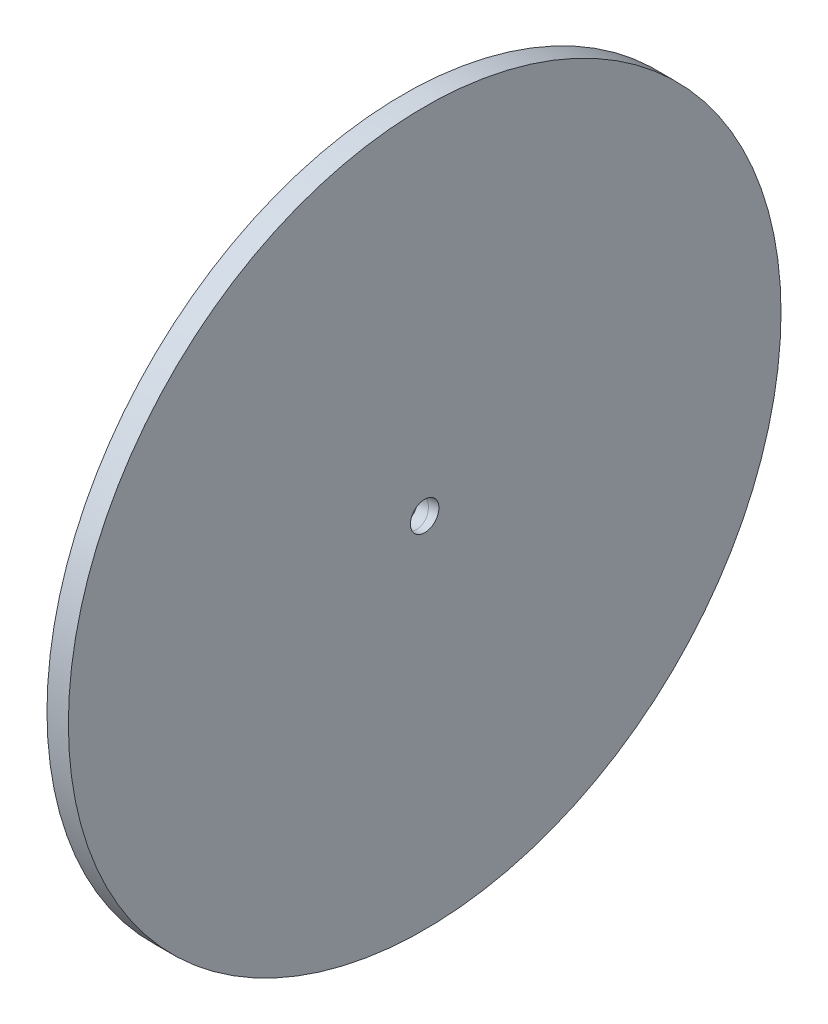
from build123d import *

# Parameters (mm, degrees)
SKETCH1_R            = 50
BOSS_EXTRUDE1_DEPTH  = 3
CUT_SWEEP1_PROFILE_R = 2


with BuildPart() as part:
    # Sketch1 → Boss-Extrude1 (new body)
    with BuildSketch(Plane(origin=(0, 0, 0), x_dir=(0, 0, -1), z_dir=(1, 0, 0))):
        Circle(SKETCH1_R)
    extrude(amount=BOSS_EXTRUDE1_DEPTH)

    # Cut-Sweep1: sweep along a path in Sketch2
    with BuildLine(Plane.XY) as cut_sweep1_path:
        Line((29.443062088, 4.92711577), (1.5, 0))
        Line((1.5, 0), (-24.768706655, -4.631881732))
    # Cut-Sweep1 profile (on start of the path) → Cut-Sweep1 (sweep, cut)
    with BuildSketch(Plane(origin=(29.443062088, 4.92711577, 0), x_dir=(0.17364817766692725, -0.9848077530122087, 0), z_dir=(-0.9848077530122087, -0.17364817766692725, 0))):
        Circle(CUT_SWEEP1_PROFILE_R)
    sweep(path=cut_sweep1_path.line, mode=Mode.SUBTRACT)


solid = part.part
